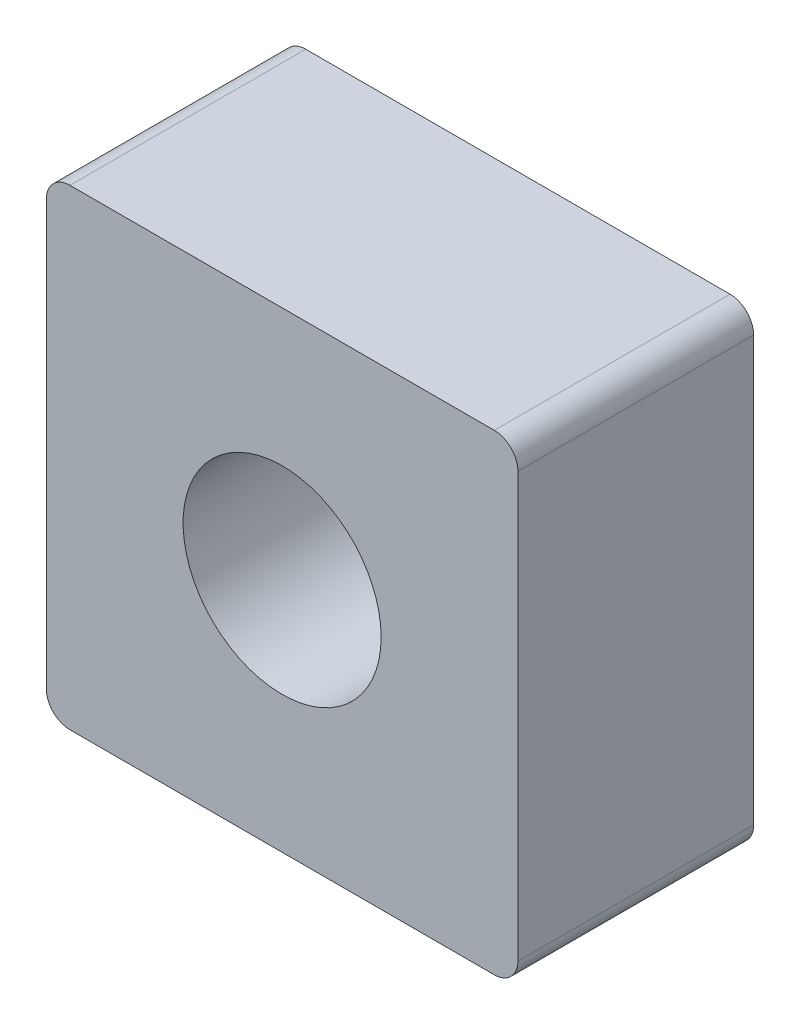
ISO-10303-21;
HEADER;
FILE_DESCRIPTION(('STEP AP214'),'2;1');
FILE_NAME('part.step','',(''),(''),'','','');
FILE_SCHEMA(('AUTOMOTIVE_DESIGN { 1 0 10303 214 1 1 1 1 }'));
ENDSEC;
DATA;
#1=APPLICATION_CONTEXT('core data for automotive mechanical design processes');
#2=APPLICATION_PROTOCOL_DEFINITION('international standard','automotive_design',2000,#1);
#3=PRODUCT_CONTEXT('',#1,'mechanical');
#4=PRODUCT('Part','Part','',(#3));
#5=PRODUCT_RELATED_PRODUCT_CATEGORY('part','',(#4));
#6=PRODUCT_DEFINITION_FORMATION('','',#4);
#7=PRODUCT_DEFINITION_CONTEXT('part definition',#1,'design');
#8=PRODUCT_DEFINITION('design','',#6,#7);
#9=PRODUCT_DEFINITION_SHAPE('','',#8);
#10=(LENGTH_UNIT() NAMED_UNIT(*) SI_UNIT(.MILLI.,.METRE.));
#11=(NAMED_UNIT(*) PLANE_ANGLE_UNIT() SI_UNIT($,.RADIAN.));
#12=(NAMED_UNIT(*) SI_UNIT($,.STERADIAN.) SOLID_ANGLE_UNIT());
#13=UNCERTAINTY_MEASURE_WITH_UNIT(LENGTH_MEASURE(1.E-05),#10,'distance_accuracy_value','');
#14=(GEOMETRIC_REPRESENTATION_CONTEXT(3) GLOBAL_UNCERTAINTY_ASSIGNED_CONTEXT((#13)) GLOBAL_UNIT_ASSIGNED_CONTEXT((#10,
#11,#12)) REPRESENTATION_CONTEXT('',''));
#15=CARTESIAN_POINT('',(0.,0.,0.));
#16=DIRECTION('',(0.,0.,1.));
#17=DIRECTION('',(1.,0.,0.));
#18=AXIS2_PLACEMENT_3D('',#15,#16,#17);
#19=CARTESIAN_POINT('',(-5.,5.,2.5));
#20=DIRECTION('',(1.,0.,0.));
#21=DIRECTION('',(0.,1.,0.));
#22=AXIS2_PLACEMENT_3D('',#19,#20,#21);
#23=PLANE('',#22);
#24=DIRECTION('',(0.,-1.,0.));
#25=VECTOR('',#24,1.);
#26=CARTESIAN_POINT('',(-5.,5.,2.5));
#27=LINE('',#26,#25);
#28=CARTESIAN_POINT('',(-5.,4.5,2.5));
#29=VERTEX_POINT('',#28);
#30=CARTESIAN_POINT('',(-5.,-4.5,2.5));
#31=VERTEX_POINT('',#30);
#32=EDGE_CURVE('E124',#29,#31,#27,.T.);
#33=ORIENTED_EDGE('',*,*,#32,.F.);
#34=DIRECTION('',(0.,0.,-1.));
#35=VECTOR('',#34,1.);
#36=CARTESIAN_POINT('',(-5.,4.5,2.5));
#37=LINE('',#36,#35);
#38=CARTESIAN_POINT('',(-5.,4.5,-2.5));
#39=VERTEX_POINT('',#38);
#40=EDGE_CURVE('E109',#29,#39,#37,.T.);
#41=ORIENTED_EDGE('',*,*,#40,.T.);
#42=DIRECTION('',(0.,-1.,0.));
#43=VECTOR('',#42,1.);
#44=CARTESIAN_POINT('',(-5.,5.,-2.5));
#45=LINE('',#44,#43);
#46=CARTESIAN_POINT('',(-5.,-4.5,-2.5));
#47=VERTEX_POINT('',#46);
#48=EDGE_CURVE('E121',#39,#47,#45,.T.);
#49=ORIENTED_EDGE('',*,*,#48,.T.);
#50=DIRECTION('',(0.,0.,-1.));
#51=VECTOR('',#50,1.);
#52=CARTESIAN_POINT('',(-5.,-4.5,2.5));
#53=LINE('',#52,#51);
#54=EDGE_CURVE('E126',#47,#31,#53,.F.);
#55=ORIENTED_EDGE('',*,*,#54,.T.);
#56=EDGE_LOOP('',(#33,#41,#49,#55));
#57=FACE_BOUND('',#56,.T.);
#58=ADVANCED_FACE('F39',(#57),#23,.F.);
#59=CARTESIAN_POINT('',(-5.,-5.,2.5));
#60=DIRECTION('',(0.,1.,0.));
#61=DIRECTION('',(0.,0.,1.));
#62=AXIS2_PLACEMENT_3D('',#59,#60,#61);
#63=PLANE('',#62);
#64=DIRECTION('',(1.,0.,0.));
#65=VECTOR('',#64,1.);
#66=CARTESIAN_POINT('',(-5.,-5.,2.5));
#67=LINE('',#66,#65);
#68=CARTESIAN_POINT('',(-4.5,-5.,2.5));
#69=VERTEX_POINT('',#68);
#70=CARTESIAN_POINT('',(4.5,-5.,2.5));
#71=VERTEX_POINT('',#70);
#72=EDGE_CURVE('E170',#69,#71,#67,.T.);
#73=ORIENTED_EDGE('',*,*,#72,.F.);
#74=DIRECTION('',(0.,0.,-1.));
#75=VECTOR('',#74,1.);
#76=CARTESIAN_POINT('',(-4.5,-5.,2.5));
#77=LINE('',#76,#75);
#78=CARTESIAN_POINT('',(-4.5,-5.,-2.5));
#79=VERTEX_POINT('',#78);
#80=EDGE_CURVE('E163',#69,#79,#77,.T.);
#81=ORIENTED_EDGE('',*,*,#80,.T.);
#82=DIRECTION('',(1.,0.,0.));
#83=VECTOR('',#82,1.);
#84=CARTESIAN_POINT('',(-5.,-5.,-2.5));
#85=LINE('',#84,#83);
#86=CARTESIAN_POINT('',(4.5,-5.,-2.5));
#87=VERTEX_POINT('',#86);
#88=EDGE_CURVE('E130',#79,#87,#85,.T.);
#89=ORIENTED_EDGE('',*,*,#88,.T.);
#90=DIRECTION('',(0.,0.,-1.));
#91=VECTOR('',#90,1.);
#92=CARTESIAN_POINT('',(4.5,-5.,2.5));
#93=LINE('',#92,#91);
#94=EDGE_CURVE('E161',#87,#71,#93,.F.);
#95=ORIENTED_EDGE('',*,*,#94,.T.);
#96=EDGE_LOOP('',(#73,#81,#89,#95));
#97=FACE_BOUND('',#96,.T.);
#98=ADVANCED_FACE('F168',(#97),#63,.F.);
#99=CARTESIAN_POINT('',(5.,5.,2.5));
#100=DIRECTION('',(-1.,0.,0.));
#101=DIRECTION('',(0.,-1.,0.));
#102=AXIS2_PLACEMENT_3D('',#99,#100,#101);
#103=PLANE('',#102);
#104=DIRECTION('',(0.,1.,0.));
#105=VECTOR('',#104,1.);
#106=CARTESIAN_POINT('',(5.,5.,2.5));
#107=LINE('',#106,#105);
#108=CARTESIAN_POINT('',(5.,-4.5,2.5));
#109=VERTEX_POINT('',#108);
#110=CARTESIAN_POINT('',(5.,4.5,2.5));
#111=VERTEX_POINT('',#110);
#112=EDGE_CURVE('E178',#109,#111,#107,.T.);
#113=ORIENTED_EDGE('',*,*,#112,.F.);
#114=DIRECTION('',(0.,0.,-1.));
#115=VECTOR('',#114,1.);
#116=CARTESIAN_POINT('',(5.,-4.5,2.5));
#117=LINE('',#116,#115);
#118=CARTESIAN_POINT('',(5.,-4.5,-2.5));
#119=VERTEX_POINT('',#118);
#120=EDGE_CURVE('E11',#109,#119,#117,.T.);
#121=ORIENTED_EDGE('',*,*,#120,.T.);
#122=DIRECTION('',(0.,1.,0.));
#123=VECTOR('',#122,1.);
#124=CARTESIAN_POINT('',(5.,5.,-2.5));
#125=LINE('',#124,#123);
#126=CARTESIAN_POINT('',(5.,4.5,-2.5));
#127=VERTEX_POINT('',#126);
#128=EDGE_CURVE('E134',#119,#127,#125,.T.);
#129=ORIENTED_EDGE('',*,*,#128,.T.);
#130=DIRECTION('',(0.,0.,-1.));
#131=VECTOR('',#130,1.);
#132=CARTESIAN_POINT('',(5.,4.5,2.5));
#133=LINE('',#132,#131);
#134=EDGE_CURVE('E47',#127,#111,#133,.F.);
#135=ORIENTED_EDGE('',*,*,#134,.T.);
#136=EDGE_LOOP('',(#113,#121,#129,#135));
#137=FACE_BOUND('',#136,.T.);
#138=ADVANCED_FACE('F177',(#137),#103,.F.);
#139=CARTESIAN_POINT('',(-5.,5.,2.5));
#140=DIRECTION('',(0.,-1.,0.));
#141=DIRECTION('',(1.,0.,0.));
#142=AXIS2_PLACEMENT_3D('',#139,#140,#141);
#143=PLANE('',#142);
#144=DIRECTION('',(-1.,0.,0.));
#145=VECTOR('',#144,1.);
#146=CARTESIAN_POINT('',(-5.,5.,-2.5));
#147=LINE('',#146,#145);
#148=CARTESIAN_POINT('',(4.5,5.,-2.5));
#149=VERTEX_POINT('',#148);
#150=CARTESIAN_POINT('',(-4.5,5.,-2.5));
#151=VERTEX_POINT('',#150);
#152=EDGE_CURVE('E144',#149,#151,#147,.T.);
#153=ORIENTED_EDGE('',*,*,#152,.T.);
#154=DIRECTION('',(0.,0.,-1.));
#155=VECTOR('',#154,1.);
#156=CARTESIAN_POINT('',(-4.5,5.,2.5));
#157=LINE('',#156,#155);
#158=CARTESIAN_POINT('',(-4.5,5.,2.5));
#159=VERTEX_POINT('',#158);
#160=EDGE_CURVE('E110',#151,#159,#157,.F.);
#161=ORIENTED_EDGE('',*,*,#160,.T.);
#162=DIRECTION('',(-1.,0.,0.));
#163=VECTOR('',#162,1.);
#164=CARTESIAN_POINT('',(-5.,5.,2.5));
#165=LINE('',#164,#163);
#166=CARTESIAN_POINT('',(4.5,5.,2.5));
#167=VERTEX_POINT('',#166);
#168=EDGE_CURVE('E140',#167,#159,#165,.T.);
#169=ORIENTED_EDGE('',*,*,#168,.F.);
#170=DIRECTION('',(0.,0.,-1.));
#171=VECTOR('',#170,1.);
#172=CARTESIAN_POINT('',(4.5,5.,2.5));
#173=LINE('',#172,#171);
#174=EDGE_CURVE('E115',#167,#149,#173,.T.);
#175=ORIENTED_EDGE('',*,*,#174,.T.);
#176=EDGE_LOOP('',(#153,#161,#169,#175));
#177=FACE_BOUND('',#176,.T.);
#178=ADVANCED_FACE('F191',(#177),#143,.F.);
#179=CARTESIAN_POINT('',(-5.,5.,2.5));
#180=DIRECTION('',(0.,0.,1.));
#181=DIRECTION('',(1.,0.,0.));
#182=AXIS2_PLACEMENT_3D('',#179,#180,#181);
#183=PLANE('',#182);
#184=CARTESIAN_POINT('',(0.,0.,2.5));
#185=DIRECTION('',(0.,0.,1.));
#186=DIRECTION('',(1.,0.,0.));
#187=AXIS2_PLACEMENT_3D('',#184,#185,#186);
#188=CIRCLE('',#187,2.1);
#189=CARTESIAN_POINT('',(2.1,0.,2.5));
#190=VERTEX_POINT('',#189);
#191=EDGE_CURVE('E137',#190,#190,#188,.T.);
#192=ORIENTED_EDGE('',*,*,#191,.F.);
#193=EDGE_LOOP('',(#192));
#194=FACE_BOUND('',#193,.T.);
#195=ORIENTED_EDGE('',*,*,#168,.T.);
#196=CARTESIAN_POINT('',(-4.5,4.5,2.5));
#197=DIRECTION('',(0.,0.,1.));
#198=DIRECTION('',(1.,0.,0.));
#199=AXIS2_PLACEMENT_3D('',#196,#197,#198);
#200=CIRCLE('',#199,0.5);
#201=EDGE_CURVE('E159',#159,#29,#200,.T.);
#202=ORIENTED_EDGE('',*,*,#201,.T.);
#203=ORIENTED_EDGE('',*,*,#32,.T.);
#204=CARTESIAN_POINT('',(-4.5,-4.5,2.5));
#205=DIRECTION('',(0.,0.,1.));
#206=DIRECTION('',(1.,0.,0.));
#207=AXIS2_PLACEMENT_3D('',#204,#205,#206);
#208=CIRCLE('',#207,0.5);
#209=EDGE_CURVE('E157',#31,#69,#208,.T.);
#210=ORIENTED_EDGE('',*,*,#209,.T.);
#211=ORIENTED_EDGE('',*,*,#72,.T.);
#212=CARTESIAN_POINT('',(4.5,-4.5,2.5));
#213=DIRECTION('',(0.,0.,1.));
#214=DIRECTION('',(1.,0.,0.));
#215=AXIS2_PLACEMENT_3D('',#212,#213,#214);
#216=CIRCLE('',#215,0.5);
#217=EDGE_CURVE('E60',#71,#109,#216,.T.);
#218=ORIENTED_EDGE('',*,*,#217,.T.);
#219=ORIENTED_EDGE('',*,*,#112,.T.);
#220=CARTESIAN_POINT('',(4.5,4.5,2.5));
#221=DIRECTION('',(0.,0.,1.));
#222=DIRECTION('',(1.,0.,0.));
#223=AXIS2_PLACEMENT_3D('',#220,#221,#222);
#224=CIRCLE('',#223,0.5);
#225=EDGE_CURVE('E154',#111,#167,#224,.T.);
#226=ORIENTED_EDGE('',*,*,#225,.T.);
#227=EDGE_LOOP('',(#195,#202,#203,#210,#211,#218,#219,#226));
#228=FACE_BOUND('',#227,.T.);
#229=ADVANCED_FACE('F189',(#194,#228),#183,.T.);
#230=CARTESIAN_POINT('',(-5.,5.,-2.5));
#231=DIRECTION('',(0.,0.,1.));
#232=DIRECTION('',(1.,0.,0.));
#233=AXIS2_PLACEMENT_3D('',#230,#231,#232);
#234=PLANE('',#233);
#235=CARTESIAN_POINT('',(0.,0.,-2.5));
#236=DIRECTION('',(0.,0.,1.));
#237=DIRECTION('',(1.,0.,0.));
#238=AXIS2_PLACEMENT_3D('',#235,#236,#237);
#239=CIRCLE('',#238,2.1);
#240=CARTESIAN_POINT('',(2.1,0.,-2.5));
#241=VERTEX_POINT('',#240);
#242=EDGE_CURVE('E131',#241,#241,#239,.T.);
#243=ORIENTED_EDGE('',*,*,#242,.T.);
#244=EDGE_LOOP('',(#243));
#245=FACE_BOUND('',#244,.T.);
#246=ORIENTED_EDGE('',*,*,#48,.F.);
#247=CARTESIAN_POINT('',(-4.5,4.5,-2.5));
#248=DIRECTION('',(0.,0.,1.));
#249=DIRECTION('',(1.,0.,0.));
#250=AXIS2_PLACEMENT_3D('',#247,#248,#249);
#251=CIRCLE('',#250,0.5);
#252=EDGE_CURVE('E105',#39,#151,#251,.F.);
#253=ORIENTED_EDGE('',*,*,#252,.T.);
#254=ORIENTED_EDGE('',*,*,#152,.F.);
#255=CARTESIAN_POINT('',(4.5,4.5,-2.5));
#256=DIRECTION('',(0.,0.,1.));
#257=DIRECTION('',(1.,0.,0.));
#258=AXIS2_PLACEMENT_3D('',#255,#256,#257);
#259=CIRCLE('',#258,0.5);
#260=EDGE_CURVE('E125',#149,#127,#259,.F.);
#261=ORIENTED_EDGE('',*,*,#260,.T.);
#262=ORIENTED_EDGE('',*,*,#128,.F.);
#263=CARTESIAN_POINT('',(4.5,-4.5,-2.5));
#264=DIRECTION('',(0.,0.,1.));
#265=DIRECTION('',(1.,0.,0.));
#266=AXIS2_PLACEMENT_3D('',#263,#264,#265);
#267=CIRCLE('',#266,0.5);
#268=EDGE_CURVE('E148',#119,#87,#267,.F.);
#269=ORIENTED_EDGE('',*,*,#268,.T.);
#270=ORIENTED_EDGE('',*,*,#88,.F.);
#271=CARTESIAN_POINT('',(-4.5,-4.5,-2.5));
#272=DIRECTION('',(0.,0.,1.));
#273=DIRECTION('',(1.,0.,0.));
#274=AXIS2_PLACEMENT_3D('',#271,#272,#273);
#275=CIRCLE('',#274,0.5);
#276=EDGE_CURVE('E116',#79,#47,#275,.F.);
#277=ORIENTED_EDGE('',*,*,#276,.T.);
#278=EDGE_LOOP('',(#246,#253,#254,#261,#262,#269,#270,#277));
#279=FACE_BOUND('',#278,.T.);
#280=ADVANCED_FACE('F128',(#245,#279),#234,.F.);
#281=CARTESIAN_POINT('',(0.,0.,2.5));
#282=DIRECTION('',(0.,0.,1.));
#283=DIRECTION('',(1.,0.,0.));
#284=AXIS2_PLACEMENT_3D('',#281,#282,#283);
#285=CYLINDRICAL_SURFACE('',#284,2.1);
#286=ORIENTED_EDGE('',*,*,#242,.F.);
#287=EDGE_LOOP('',(#286));
#288=FACE_BOUND('',#287,.T.);
#289=ORIENTED_EDGE('',*,*,#191,.T.);
#290=EDGE_LOOP('',(#289));
#291=FACE_BOUND('',#290,.T.);
#292=ADVANCED_FACE('F187',(#288,#291),#285,.F.);
#293=CARTESIAN_POINT('',(-4.5,4.5,2.5));
#294=DIRECTION('',(0.,0.,-1.));
#295=DIRECTION('',(-1.,0.,0.));
#296=AXIS2_PLACEMENT_3D('',#293,#294,#295);
#297=CYLINDRICAL_SURFACE('',#296,0.5);
#298=ORIENTED_EDGE('',*,*,#201,.F.);
#299=ORIENTED_EDGE('',*,*,#160,.F.);
#300=ORIENTED_EDGE('',*,*,#252,.F.);
#301=ORIENTED_EDGE('',*,*,#40,.F.);
#302=EDGE_LOOP('',(#298,#299,#300,#301));
#303=FACE_BOUND('',#302,.T.);
#304=ADVANCED_FACE('F108',(#303),#297,.T.);
#305=CARTESIAN_POINT('',(-4.5,-4.5,2.5));
#306=DIRECTION('',(0.,0.,-1.));
#307=DIRECTION('',(-1.,0.,0.));
#308=AXIS2_PLACEMENT_3D('',#305,#306,#307);
#309=CYLINDRICAL_SURFACE('',#308,0.5);
#310=ORIENTED_EDGE('',*,*,#209,.F.);
#311=ORIENTED_EDGE('',*,*,#54,.F.);
#312=ORIENTED_EDGE('',*,*,#276,.F.);
#313=ORIENTED_EDGE('',*,*,#80,.F.);
#314=EDGE_LOOP('',(#310,#311,#312,#313));
#315=FACE_BOUND('',#314,.T.);
#316=ADVANCED_FACE('F201',(#315),#309,.T.);
#317=CARTESIAN_POINT('',(4.5,-4.5,2.5));
#318=DIRECTION('',(0.,0.,-1.));
#319=DIRECTION('',(-1.,0.,0.));
#320=AXIS2_PLACEMENT_3D('',#317,#318,#319);
#321=CYLINDRICAL_SURFACE('',#320,0.5);
#322=ORIENTED_EDGE('',*,*,#217,.F.);
#323=ORIENTED_EDGE('',*,*,#94,.F.);
#324=ORIENTED_EDGE('',*,*,#268,.F.);
#325=ORIENTED_EDGE('',*,*,#120,.F.);
#326=EDGE_LOOP('',(#322,#323,#324,#325));
#327=FACE_BOUND('',#326,.T.);
#328=ADVANCED_FACE('F176',(#327),#321,.T.);
#329=CARTESIAN_POINT('',(4.5,4.5,2.5));
#330=DIRECTION('',(0.,0.,-1.));
#331=DIRECTION('',(-1.,0.,0.));
#332=AXIS2_PLACEMENT_3D('',#329,#330,#331);
#333=CYLINDRICAL_SURFACE('',#332,0.5);
#334=ORIENTED_EDGE('',*,*,#225,.F.);
#335=ORIENTED_EDGE('',*,*,#134,.F.);
#336=ORIENTED_EDGE('',*,*,#260,.F.);
#337=ORIENTED_EDGE('',*,*,#174,.F.);
#338=EDGE_LOOP('',(#334,#335,#336,#337));
#339=FACE_BOUND('',#338,.T.);
#340=ADVANCED_FACE('F41',(#339),#333,.T.);
#341=CLOSED_SHELL('',(#58,#98,#138,#178,#229,#280,#292,#304,#316,#328,#340));
#342=MANIFOLD_SOLID_BREP('B2',#341);
#343=ADVANCED_BREP_SHAPE_REPRESENTATION('',(#18,#342),#14);
#344=SHAPE_DEFINITION_REPRESENTATION(#9,#343);
ENDSEC;
END-ISO-10303-21;
